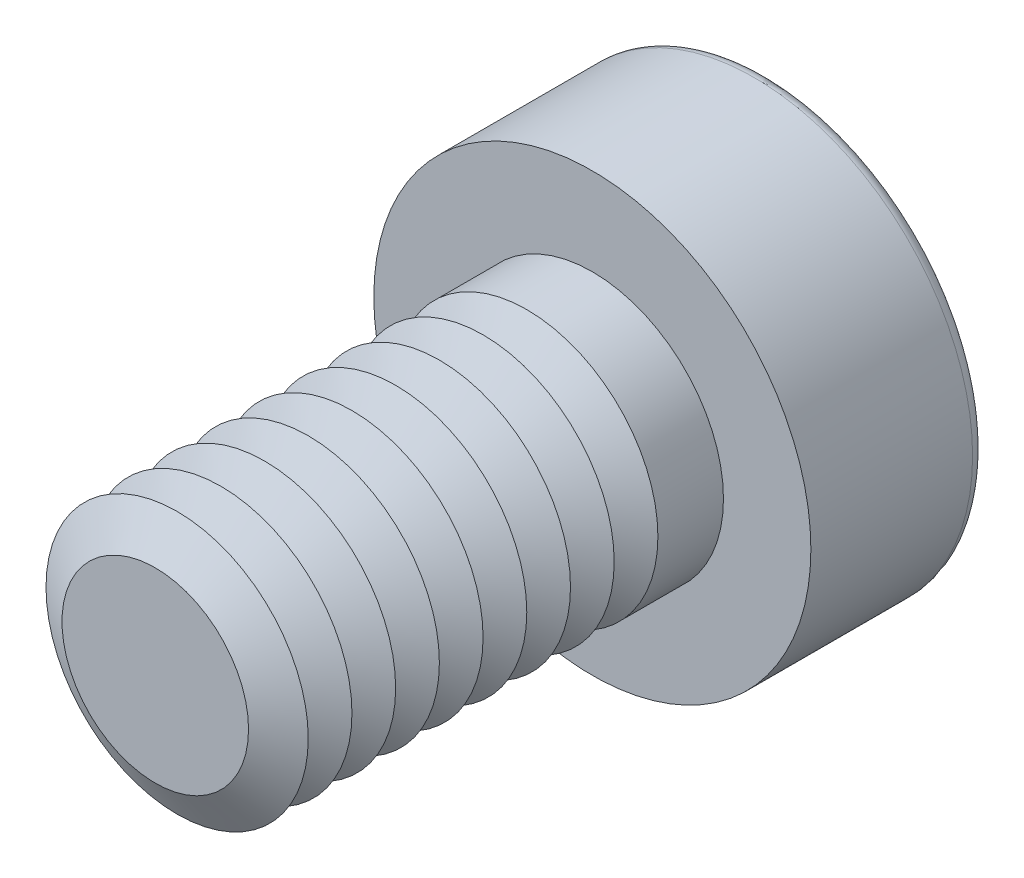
ISO-10303-21;
HEADER;
FILE_DESCRIPTION(('STEP AP214'),'2;1');
FILE_NAME('part.step','',(''),(''),'','','');
FILE_SCHEMA(('AUTOMOTIVE_DESIGN { 1 0 10303 214 1 1 1 1 }'));
ENDSEC;
DATA;
#1=APPLICATION_CONTEXT('core data for automotive mechanical design processes');
#2=APPLICATION_PROTOCOL_DEFINITION('international standard','automotive_design',2000,#1);
#3=PRODUCT_CONTEXT('',#1,'mechanical');
#4=PRODUCT('Part','Part','',(#3));
#5=PRODUCT_RELATED_PRODUCT_CATEGORY('part','',(#4));
#6=PRODUCT_DEFINITION_FORMATION('','',#4);
#7=PRODUCT_DEFINITION_CONTEXT('part definition',#1,'design');
#8=PRODUCT_DEFINITION('design','',#6,#7);
#9=PRODUCT_DEFINITION_SHAPE('','',#8);
#10=(LENGTH_UNIT() NAMED_UNIT(*) SI_UNIT(.MILLI.,.METRE.));
#11=(NAMED_UNIT(*) PLANE_ANGLE_UNIT() SI_UNIT($,.RADIAN.));
#12=(NAMED_UNIT(*) SI_UNIT($,.STERADIAN.) SOLID_ANGLE_UNIT());
#13=UNCERTAINTY_MEASURE_WITH_UNIT(LENGTH_MEASURE(1.E-05),#10,'distance_accuracy_value','');
#14=(GEOMETRIC_REPRESENTATION_CONTEXT(3) GLOBAL_UNCERTAINTY_ASSIGNED_CONTEXT((#13)) GLOBAL_UNIT_ASSIGNED_CONTEXT((#10,
#11,#12)) REPRESENTATION_CONTEXT('',''));
#15=CARTESIAN_POINT('',(0.,0.,0.));
#16=DIRECTION('',(0.,0.,1.));
#17=DIRECTION('',(1.,0.,0.));
#18=AXIS2_PLACEMENT_3D('',#15,#16,#17);
#19=CARTESIAN_POINT('',(0.,0.,6.5));
#20=DIRECTION('',(0.,0.,1.));
#21=DIRECTION('',(1.,0.,0.));
#22=AXIS2_PLACEMENT_3D('',#19,#20,#21);
#23=CONICAL_SURFACE('',#22,3.,1.0471975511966);
#24=CARTESIAN_POINT('',(0.,0.,6.));
#25=DIRECTION('',(0.,0.,1.));
#26=DIRECTION('',(1.,0.,0.));
#27=AXIS2_PLACEMENT_3D('',#24,#25,#26);
#28=CIRCLE('',#27,2.13397459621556);
#29=CARTESIAN_POINT('',(2.13397459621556,0.,6.));
#30=VERTEX_POINT('',#29);
#31=EDGE_CURVE('E312',#30,#30,#28,.T.);
#32=ORIENTED_EDGE('',*,*,#31,.T.);
#33=EDGE_LOOP('',(#32));
#34=FACE_BOUND('',#33,.T.);
#35=CARTESIAN_POINT('',(0.,0.,6.5));
#36=DIRECTION('',(0.,0.,1.));
#37=DIRECTION('',(1.,0.,0.));
#38=AXIS2_PLACEMENT_3D('',#35,#36,#37);
#39=CIRCLE('',#38,3.);
#40=CARTESIAN_POINT('',(3.,0.,6.5));
#41=VERTEX_POINT('',#40);
#42=EDGE_CURVE('E315',#41,#41,#39,.T.);
#43=ORIENTED_EDGE('',*,*,#42,.F.);
#44=EDGE_LOOP('',(#43));
#45=FACE_BOUND('',#44,.T.);
#46=ADVANCED_FACE('F39',(#34,#45),#23,.T.);
#47=CARTESIAN_POINT('',(0.,0.,6.));
#48=DIRECTION('',(0.,0.,-1.));
#49=DIRECTION('',(-1.,0.,0.));
#50=AXIS2_PLACEMENT_3D('',#47,#48,#49);
#51=CONICAL_SURFACE('',#50,2.13397459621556,1.0471975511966);
#52=CARTESIAN_POINT('',(0.,0.,5.5));
#53=DIRECTION('',(0.,0.,1.));
#54=DIRECTION('',(1.,0.,0.));
#55=AXIS2_PLACEMENT_3D('',#52,#53,#54);
#56=CIRCLE('',#55,3.);
#57=CARTESIAN_POINT('',(3.,0.,5.5));
#58=VERTEX_POINT('',#57);
#59=EDGE_CURVE('E323',#58,#58,#56,.T.);
#60=ORIENTED_EDGE('',*,*,#59,.T.);
#61=EDGE_LOOP('',(#60));
#62=FACE_BOUND('',#61,.T.);
#63=ORIENTED_EDGE('',*,*,#31,.F.);
#64=EDGE_LOOP('',(#63));
#65=FACE_BOUND('',#64,.T.);
#66=ADVANCED_FACE('F244',(#62,#65),#51,.T.);
#67=CARTESIAN_POINT('',(0.,0.,10.));
#68=DIRECTION('',(0.,0.,1.));
#69=DIRECTION('',(1.,0.,0.));
#70=AXIS2_PLACEMENT_3D('',#67,#68,#69);
#71=PLANE('',#70);
#72=CARTESIAN_POINT('',(0.,0.,10.));
#73=DIRECTION('',(0.,0.,1.));
#74=DIRECTION('',(1.,0.,0.));
#75=AXIS2_PLACEMENT_3D('',#72,#73,#74);
#76=CIRCLE('',#75,2.13397459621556);
#77=CARTESIAN_POINT('',(2.13397459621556,0.,10.));
#78=VERTEX_POINT('',#77);
#79=EDGE_CURVE('E174',#78,#78,#76,.T.);
#80=ORIENTED_EDGE('',*,*,#79,.T.);
#81=EDGE_LOOP('',(#80));
#82=FACE_BOUND('',#81,.T.);
#83=ADVANCED_FACE('F250',(#82),#71,.T.);
#84=CARTESIAN_POINT('',(0.,0.,10.));
#85=DIRECTION('',(0.,0.,-1.));
#86=DIRECTION('',(-1.,0.,0.));
#87=AXIS2_PLACEMENT_3D('',#84,#85,#86);
#88=CONICAL_SURFACE('',#87,2.13397459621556,1.0471975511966);
#89=CARTESIAN_POINT('',(0.,0.,9.5));
#90=DIRECTION('',(0.,0.,1.));
#91=DIRECTION('',(1.,0.,0.));
#92=AXIS2_PLACEMENT_3D('',#89,#90,#91);
#93=CIRCLE('',#92,3.);
#94=CARTESIAN_POINT('',(3.,0.,9.5));
#95=VERTEX_POINT('',#94);
#96=EDGE_CURVE('E290',#95,#95,#93,.T.);
#97=ORIENTED_EDGE('',*,*,#96,.T.);
#98=EDGE_LOOP('',(#97));
#99=FACE_BOUND('',#98,.T.);
#100=ORIENTED_EDGE('',*,*,#79,.F.);
#101=EDGE_LOOP('',(#100));
#102=FACE_BOUND('',#101,.T.);
#103=ADVANCED_FACE('F198',(#99,#102),#88,.T.);
#104=CARTESIAN_POINT('',(0.,0.,9.5));
#105=DIRECTION('',(0.,0.,1.));
#106=DIRECTION('',(1.,0.,0.));
#107=AXIS2_PLACEMENT_3D('',#104,#105,#106);
#108=CONICAL_SURFACE('',#107,3.,1.0471975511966);
#109=CARTESIAN_POINT('',(0.,0.,9.));
#110=DIRECTION('',(0.,0.,1.));
#111=DIRECTION('',(1.,0.,0.));
#112=AXIS2_PLACEMENT_3D('',#109,#110,#111);
#113=CIRCLE('',#112,2.13397459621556);
#114=CARTESIAN_POINT('',(2.13397459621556,0.,9.));
#115=VERTEX_POINT('',#114);
#116=EDGE_CURVE('E287',#115,#115,#113,.T.);
#117=ORIENTED_EDGE('',*,*,#116,.T.);
#118=EDGE_LOOP('',(#117));
#119=FACE_BOUND('',#118,.T.);
#120=ORIENTED_EDGE('',*,*,#96,.F.);
#121=EDGE_LOOP('',(#120));
#122=FACE_BOUND('',#121,.T.);
#123=ADVANCED_FACE('F276',(#119,#122),#108,.T.);
#124=CARTESIAN_POINT('',(0.,0.,9.));
#125=DIRECTION('',(0.,0.,-1.));
#126=DIRECTION('',(-1.,0.,0.));
#127=AXIS2_PLACEMENT_3D('',#124,#125,#126);
#128=CONICAL_SURFACE('',#127,2.13397459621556,1.0471975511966);
#129=CARTESIAN_POINT('',(0.,0.,8.5));
#130=DIRECTION('',(0.,0.,1.));
#131=DIRECTION('',(1.,0.,0.));
#132=AXIS2_PLACEMENT_3D('',#129,#130,#131);
#133=CIRCLE('',#132,3.);
#134=CARTESIAN_POINT('',(3.,0.,8.5));
#135=VERTEX_POINT('',#134);
#136=EDGE_CURVE('E298',#135,#135,#133,.T.);
#137=ORIENTED_EDGE('',*,*,#136,.T.);
#138=EDGE_LOOP('',(#137));
#139=FACE_BOUND('',#138,.T.);
#140=ORIENTED_EDGE('',*,*,#116,.F.);
#141=EDGE_LOOP('',(#140));
#142=FACE_BOUND('',#141,.T.);
#143=ADVANCED_FACE('F273',(#139,#142),#128,.T.);
#144=CARTESIAN_POINT('',(0.,0.,8.5));
#145=DIRECTION('',(0.,0.,1.));
#146=DIRECTION('',(1.,0.,0.));
#147=AXIS2_PLACEMENT_3D('',#144,#145,#146);
#148=CONICAL_SURFACE('',#147,3.,1.0471975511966);
#149=CARTESIAN_POINT('',(0.,0.,8.));
#150=DIRECTION('',(0.,0.,1.));
#151=DIRECTION('',(1.,0.,0.));
#152=AXIS2_PLACEMENT_3D('',#149,#150,#151);
#153=CIRCLE('',#152,2.13397459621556);
#154=CARTESIAN_POINT('',(2.13397459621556,0.,8.));
#155=VERTEX_POINT('',#154);
#156=EDGE_CURVE('E292',#155,#155,#153,.T.);
#157=ORIENTED_EDGE('',*,*,#156,.T.);
#158=EDGE_LOOP('',(#157));
#159=FACE_BOUND('',#158,.T.);
#160=ORIENTED_EDGE('',*,*,#136,.F.);
#161=EDGE_LOOP('',(#160));
#162=FACE_BOUND('',#161,.T.);
#163=ADVANCED_FACE('F269',(#159,#162),#148,.T.);
#164=CARTESIAN_POINT('',(0.,0.,8.));
#165=DIRECTION('',(0.,0.,-1.));
#166=DIRECTION('',(-1.,0.,0.));
#167=AXIS2_PLACEMENT_3D('',#164,#165,#166);
#168=CONICAL_SURFACE('',#167,2.13397459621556,1.0471975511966);
#169=CARTESIAN_POINT('',(0.,0.,7.5));
#170=DIRECTION('',(0.,0.,1.));
#171=DIRECTION('',(1.,0.,0.));
#172=AXIS2_PLACEMENT_3D('',#169,#170,#171);
#173=CIRCLE('',#172,3.);
#174=CARTESIAN_POINT('',(3.,0.,7.5));
#175=VERTEX_POINT('',#174);
#176=EDGE_CURVE('E308',#175,#175,#173,.T.);
#177=ORIENTED_EDGE('',*,*,#176,.T.);
#178=EDGE_LOOP('',(#177));
#179=FACE_BOUND('',#178,.T.);
#180=ORIENTED_EDGE('',*,*,#156,.F.);
#181=EDGE_LOOP('',(#180));
#182=FACE_BOUND('',#181,.T.);
#183=ADVANCED_FACE('F265',(#179,#182),#168,.T.);
#184=CARTESIAN_POINT('',(0.,0.,7.5));
#185=DIRECTION('',(0.,0.,1.));
#186=DIRECTION('',(1.,0.,0.));
#187=AXIS2_PLACEMENT_3D('',#184,#185,#186);
#188=CONICAL_SURFACE('',#187,3.,1.0471975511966);
#189=CARTESIAN_POINT('',(0.,0.,7.));
#190=DIRECTION('',(0.,0.,1.));
#191=DIRECTION('',(1.,0.,0.));
#192=AXIS2_PLACEMENT_3D('',#189,#190,#191);
#193=CIRCLE('',#192,2.13397459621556);
#194=CARTESIAN_POINT('',(2.13397459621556,0.,7.));
#195=VERTEX_POINT('',#194);
#196=EDGE_CURVE('E304',#195,#195,#193,.T.);
#197=ORIENTED_EDGE('',*,*,#196,.T.);
#198=EDGE_LOOP('',(#197));
#199=FACE_BOUND('',#198,.T.);
#200=ORIENTED_EDGE('',*,*,#176,.F.);
#201=EDGE_LOOP('',(#200));
#202=FACE_BOUND('',#201,.T.);
#203=ADVANCED_FACE('F261',(#199,#202),#188,.T.);
#204=CARTESIAN_POINT('',(0.,0.,7.));
#205=DIRECTION('',(0.,0.,-1.));
#206=DIRECTION('',(-1.,0.,0.));
#207=AXIS2_PLACEMENT_3D('',#204,#205,#206);
#208=CONICAL_SURFACE('',#207,2.13397459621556,1.0471975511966);
#209=ORIENTED_EDGE('',*,*,#42,.T.);
#210=EDGE_LOOP('',(#209));
#211=FACE_BOUND('',#210,.T.);
#212=ORIENTED_EDGE('',*,*,#196,.F.);
#213=EDGE_LOOP('',(#212));
#214=FACE_BOUND('',#213,.T.);
#215=ADVANCED_FACE('F257',(#211,#214),#208,.T.);
#216=CARTESIAN_POINT('',(0.,0.,5.5));
#217=DIRECTION('',(0.,0.,1.));
#218=DIRECTION('',(1.,0.,0.));
#219=AXIS2_PLACEMENT_3D('',#216,#217,#218);
#220=CONICAL_SURFACE('',#219,3.,1.0471975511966);
#221=CARTESIAN_POINT('',(0.,0.,5.));
#222=DIRECTION('',(0.,0.,1.));
#223=DIRECTION('',(1.,0.,0.));
#224=AXIS2_PLACEMENT_3D('',#221,#222,#223);
#225=CIRCLE('',#224,2.13397459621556);
#226=CARTESIAN_POINT('',(2.13397459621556,0.,5.));
#227=VERTEX_POINT('',#226);
#228=EDGE_CURVE('E319',#227,#227,#225,.T.);
#229=ORIENTED_EDGE('',*,*,#228,.T.);
#230=EDGE_LOOP('',(#229));
#231=FACE_BOUND('',#230,.T.);
#232=ORIENTED_EDGE('',*,*,#59,.F.);
#233=EDGE_LOOP('',(#232));
#234=FACE_BOUND('',#233,.T.);
#235=ADVANCED_FACE('F260',(#231,#234),#220,.T.);
#236=CARTESIAN_POINT('',(0.,0.,5.));
#237=DIRECTION('',(0.,0.,-1.));
#238=DIRECTION('',(-1.,0.,0.));
#239=AXIS2_PLACEMENT_3D('',#236,#237,#238);
#240=CONICAL_SURFACE('',#239,2.13397459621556,1.0471975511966);
#241=CARTESIAN_POINT('',(0.,0.,4.5));
#242=DIRECTION('',(0.,0.,1.));
#243=DIRECTION('',(1.,0.,0.));
#244=AXIS2_PLACEMENT_3D('',#241,#242,#243);
#245=CIRCLE('',#244,3.);
#246=CARTESIAN_POINT('',(3.,0.,4.5));
#247=VERTEX_POINT('',#246);
#248=EDGE_CURVE('E330',#247,#247,#245,.T.);
#249=ORIENTED_EDGE('',*,*,#248,.T.);
#250=EDGE_LOOP('',(#249));
#251=FACE_BOUND('',#250,.T.);
#252=ORIENTED_EDGE('',*,*,#228,.F.);
#253=EDGE_LOOP('',(#252));
#254=FACE_BOUND('',#253,.T.);
#255=ADVANCED_FACE('F384',(#251,#254),#240,.T.);
#256=CARTESIAN_POINT('',(0.,0.,4.5));
#257=DIRECTION('',(0.,0.,1.));
#258=DIRECTION('',(1.,0.,0.));
#259=AXIS2_PLACEMENT_3D('',#256,#257,#258);
#260=CONICAL_SURFACE('',#259,3.,1.0471975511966);
#261=CARTESIAN_POINT('',(0.,0.,4.));
#262=DIRECTION('',(0.,0.,1.));
#263=DIRECTION('',(1.,0.,0.));
#264=AXIS2_PLACEMENT_3D('',#261,#262,#263);
#265=CIRCLE('',#264,2.13397459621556);
#266=CARTESIAN_POINT('',(2.13397459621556,0.,4.));
#267=VERTEX_POINT('',#266);
#268=EDGE_CURVE('E326',#267,#267,#265,.T.);
#269=ORIENTED_EDGE('',*,*,#268,.T.);
#270=EDGE_LOOP('',(#269));
#271=FACE_BOUND('',#270,.T.);
#272=ORIENTED_EDGE('',*,*,#248,.F.);
#273=EDGE_LOOP('',(#272));
#274=FACE_BOUND('',#273,.T.);
#275=ADVANCED_FACE('F380',(#271,#274),#260,.T.);
#276=CARTESIAN_POINT('',(0.,0.,4.));
#277=DIRECTION('',(0.,0.,-1.));
#278=DIRECTION('',(-1.,0.,0.));
#279=AXIS2_PLACEMENT_3D('',#276,#277,#278);
#280=CONICAL_SURFACE('',#279,2.13397459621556,1.0471975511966);
#281=CARTESIAN_POINT('',(0.,0.,3.5));
#282=DIRECTION('',(0.,0.,1.));
#283=DIRECTION('',(1.,0.,0.));
#284=AXIS2_PLACEMENT_3D('',#281,#282,#283);
#285=CIRCLE('',#284,3.);
#286=CARTESIAN_POINT('',(3.,0.,3.5));
#287=VERTEX_POINT('',#286);
#288=EDGE_CURVE('E338',#287,#287,#285,.T.);
#289=ORIENTED_EDGE('',*,*,#288,.T.);
#290=EDGE_LOOP('',(#289));
#291=FACE_BOUND('',#290,.T.);
#292=ORIENTED_EDGE('',*,*,#268,.F.);
#293=EDGE_LOOP('',(#292));
#294=FACE_BOUND('',#293,.T.);
#295=ADVANCED_FACE('F376',(#291,#294),#280,.T.);
#296=CARTESIAN_POINT('',(0.,0.,3.5));
#297=DIRECTION('',(0.,0.,1.));
#298=DIRECTION('',(1.,0.,0.));
#299=AXIS2_PLACEMENT_3D('',#296,#297,#298);
#300=CONICAL_SURFACE('',#299,3.,1.0471975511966);
#301=CARTESIAN_POINT('',(0.,0.,3.));
#302=DIRECTION('',(0.,0.,1.));
#303=DIRECTION('',(1.,0.,0.));
#304=AXIS2_PLACEMENT_3D('',#301,#302,#303);
#305=CIRCLE('',#304,2.13397459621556);
#306=CARTESIAN_POINT('',(2.13397459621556,0.,3.));
#307=VERTEX_POINT('',#306);
#308=EDGE_CURVE('E334',#307,#307,#305,.T.);
#309=ORIENTED_EDGE('',*,*,#308,.T.);
#310=EDGE_LOOP('',(#309));
#311=FACE_BOUND('',#310,.T.);
#312=ORIENTED_EDGE('',*,*,#288,.F.);
#313=EDGE_LOOP('',(#312));
#314=FACE_BOUND('',#313,.T.);
#315=ADVANCED_FACE('F371',(#311,#314),#300,.T.);
#316=CARTESIAN_POINT('',(0.,0.,3.));
#317=DIRECTION('',(0.,0.,-1.));
#318=DIRECTION('',(-1.,0.,0.));
#319=AXIS2_PLACEMENT_3D('',#316,#317,#318);
#320=CONICAL_SURFACE('',#319,2.13397459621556,1.0471975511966);
#321=CARTESIAN_POINT('',(0.,0.,2.5));
#322=DIRECTION('',(0.,0.,1.));
#323=DIRECTION('',(1.,0.,0.));
#324=AXIS2_PLACEMENT_3D('',#321,#322,#323);
#325=CIRCLE('',#324,3.);
#326=CARTESIAN_POINT('',(3.,0.,2.5));
#327=VERTEX_POINT('',#326);
#328=EDGE_CURVE('E350',#327,#327,#325,.T.);
#329=ORIENTED_EDGE('',*,*,#328,.T.);
#330=EDGE_LOOP('',(#329));
#331=FACE_BOUND('',#330,.T.);
#332=ORIENTED_EDGE('',*,*,#308,.F.);
#333=EDGE_LOOP('',(#332));
#334=FACE_BOUND('',#333,.T.);
#335=ADVANCED_FACE('F357',(#331,#334),#320,.T.);
#336=CARTESIAN_POINT('',(0.,0.,2.5));
#337=DIRECTION('',(0.,0.,1.));
#338=DIRECTION('',(1.,0.,0.));
#339=AXIS2_PLACEMENT_3D('',#336,#337,#338);
#340=CONICAL_SURFACE('',#339,3.,1.0471975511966);
#341=CARTESIAN_POINT('',(0.,0.,2.));
#342=DIRECTION('',(0.,0.,1.));
#343=DIRECTION('',(1.,0.,0.));
#344=AXIS2_PLACEMENT_3D('',#341,#342,#343);
#345=CIRCLE('',#344,2.13397459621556);
#346=CARTESIAN_POINT('',(2.13397459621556,0.,2.));
#347=VERTEX_POINT('',#346);
#348=EDGE_CURVE('E342',#347,#347,#345,.T.);
#349=ORIENTED_EDGE('',*,*,#348,.T.);
#350=EDGE_LOOP('',(#349));
#351=FACE_BOUND('',#350,.T.);
#352=ORIENTED_EDGE('',*,*,#328,.F.);
#353=EDGE_LOOP('',(#352));
#354=FACE_BOUND('',#353,.T.);
#355=ADVANCED_FACE('F360',(#351,#354),#340,.T.);
#356=CARTESIAN_POINT('',(0.,0.,2.));
#357=DIRECTION('',(0.,0.,-1.));
#358=DIRECTION('',(-1.,0.,0.));
#359=AXIS2_PLACEMENT_3D('',#356,#357,#358);
#360=CONICAL_SURFACE('',#359,2.13397459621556,1.0471975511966);
#361=CARTESIAN_POINT('',(0.,0.,1.5));
#362=DIRECTION('',(0.,0.,1.));
#363=DIRECTION('',(1.,0.,0.));
#364=AXIS2_PLACEMENT_3D('',#361,#362,#363);
#365=CIRCLE('',#364,3.);
#366=CARTESIAN_POINT('',(3.,0.,1.5));
#367=VERTEX_POINT('',#366);
#368=EDGE_CURVE('E346',#367,#367,#365,.T.);
#369=ORIENTED_EDGE('',*,*,#368,.T.);
#370=EDGE_LOOP('',(#369));
#371=FACE_BOUND('',#370,.T.);
#372=ORIENTED_EDGE('',*,*,#348,.F.);
#373=EDGE_LOOP('',(#372));
#374=FACE_BOUND('',#373,.T.);
#375=ADVANCED_FACE('F362',(#371,#374),#360,.T.);
#376=CARTESIAN_POINT('',(0.,0.,-1.));
#377=DIRECTION('',(0.,0.,-1.));
#378=DIRECTION('',(-1.,0.,0.));
#379=AXIS2_PLACEMENT_3D('',#376,#377,#378);
#380=CONICAL_SURFACE('',#379,2.,1.0471975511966);
#381=CARTESIAN_POINT('',(0.,0.,0.154700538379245));
#382=VERTEX_POINT('',#381);
#383=VERTEX_LOOP('',#382);
#384=FACE_BOUND('',#383,.T.);
#385=CARTESIAN_POINT('',(0.,0.,-1.));
#386=DIRECTION('',(0.,0.,-1.));
#387=DIRECTION('',(-1.,0.,0.));
#388=AXIS2_PLACEMENT_3D('',#385,#386,#387);
#389=CIRCLE('',#388,2.);
#390=CARTESIAN_POINT('',(-1.73205080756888,0.999999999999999,-1.));
#391=VERTEX_POINT('',#390);
#392=CARTESIAN_POINT('',(0.,2.,-1.));
#393=VERTEX_POINT('',#392);
#394=EDGE_CURVE('E149',#391,#393,#389,.T.);
#395=ORIENTED_EDGE('',*,*,#394,.T.);
#396=CARTESIAN_POINT('',(0.,0.,-1.));
#397=DIRECTION('',(0.,0.,-1.));
#398=DIRECTION('',(-1.,0.,0.));
#399=AXIS2_PLACEMENT_3D('',#396,#397,#398);
#400=CIRCLE('',#399,2.);
#401=CARTESIAN_POINT('',(1.73205080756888,1.,-1.));
#402=VERTEX_POINT('',#401);
#403=EDGE_CURVE('E54',#393,#402,#400,.T.);
#404=ORIENTED_EDGE('',*,*,#403,.T.);
#405=CARTESIAN_POINT('',(1.73205080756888,-0.999999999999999,-1.));
#406=VERTEX_POINT('',#405);
#407=EDGE_CURVE('E788',#402,#406,#400,.T.);
#408=ORIENTED_EDGE('',*,*,#407,.T.);
#409=CARTESIAN_POINT('',(0.,-2.,-1.));
#410=VERTEX_POINT('',#409);
#411=EDGE_CURVE('E787',#406,#410,#400,.T.);
#412=ORIENTED_EDGE('',*,*,#411,.T.);
#413=CARTESIAN_POINT('',(-1.73205080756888,-0.999999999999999,-1.));
#414=VERTEX_POINT('',#413);
#415=EDGE_CURVE('E783',#410,#414,#400,.T.);
#416=ORIENTED_EDGE('',*,*,#415,.T.);
#417=EDGE_CURVE('E781',#414,#391,#400,.T.);
#418=ORIENTED_EDGE('',*,*,#417,.T.);
#419=EDGE_LOOP('',(#395,#404,#408,#412,#416,#418));
#420=FACE_BOUND('',#419,.T.);
#421=ADVANCED_FACE('F200',(#384,#420),#380,.F.);
#422=CARTESIAN_POINT('',(0.,0.,-1.));
#423=DIRECTION('',(0.,0.,-1.));
#424=DIRECTION('',(-1.,0.,0.));
#425=AXIS2_PLACEMENT_3D('',#422,#423,#424);
#426=PLANE('',#425);
#427=ORIENTED_EDGE('',*,*,#403,.F.);
#428=DIRECTION('',(1.,0.,0.));
#429=VECTOR('',#428,1.);
#430=CARTESIAN_POINT('',(-1.15470053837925,2.,-1.));
#431=LINE('',#430,#429);
#432=CARTESIAN_POINT('',(1.15470053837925,2.,-1.));
#433=VERTEX_POINT('',#432);
#434=EDGE_CURVE('E829',#393,#433,#431,.T.);
#435=ORIENTED_EDGE('',*,*,#434,.T.);
#436=DIRECTION('',(0.5,-0.866025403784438,0.));
#437=VECTOR('',#436,1.);
#438=CARTESIAN_POINT('',(1.15470053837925,2.,-1.));
#439=LINE('',#438,#437);
#440=EDGE_CURVE('E155',#433,#402,#439,.T.);
#441=ORIENTED_EDGE('',*,*,#440,.T.);
#442=EDGE_LOOP('',(#427,#435,#441));
#443=FACE_BOUND('',#442,.T.);
#444=ADVANCED_FACE('F431',(#443),#426,.T.);
#445=ORIENTED_EDGE('',*,*,#407,.F.);
#446=CARTESIAN_POINT('',(2.3094010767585,0.,-1.));
#447=VERTEX_POINT('',#446);
#448=EDGE_CURVE('E824',#402,#447,#439,.T.);
#449=ORIENTED_EDGE('',*,*,#448,.T.);
#450=DIRECTION('',(-0.5,-0.866025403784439,0.));
#451=VECTOR('',#450,1.);
#452=CARTESIAN_POINT('',(2.3094010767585,0.,-1.));
#453=LINE('',#452,#451);
#454=EDGE_CURVE('E801',#447,#406,#453,.T.);
#455=ORIENTED_EDGE('',*,*,#454,.T.);
#456=EDGE_LOOP('',(#445,#449,#455));
#457=FACE_BOUND('',#456,.T.);
#458=ADVANCED_FACE('F441',(#457),#426,.T.);
#459=ORIENTED_EDGE('',*,*,#411,.F.);
#460=CARTESIAN_POINT('',(1.15470053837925,-2.,-1.));
#461=VERTEX_POINT('',#460);
#462=EDGE_CURVE('E803',#406,#461,#453,.T.);
#463=ORIENTED_EDGE('',*,*,#462,.T.);
#464=DIRECTION('',(-1.,0.,0.));
#465=VECTOR('',#464,1.);
#466=CARTESIAN_POINT('',(1.15470053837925,-2.,-1.));
#467=LINE('',#466,#465);
#468=EDGE_CURVE('E755',#461,#410,#467,.T.);
#469=ORIENTED_EDGE('',*,*,#468,.T.);
#470=EDGE_LOOP('',(#459,#463,#469));
#471=FACE_BOUND('',#470,.T.);
#472=ADVANCED_FACE('F451',(#471),#426,.T.);
#473=ORIENTED_EDGE('',*,*,#415,.F.);
#474=CARTESIAN_POINT('',(-1.15470053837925,-2.,-1.));
#475=VERTEX_POINT('',#474);
#476=EDGE_CURVE('E798',#410,#475,#467,.T.);
#477=ORIENTED_EDGE('',*,*,#476,.T.);
#478=DIRECTION('',(-0.5,0.866025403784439,0.));
#479=VECTOR('',#478,1.);
#480=CARTESIAN_POINT('',(-1.15470053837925,-2.,-1.));
#481=LINE('',#480,#479);
#482=EDGE_CURVE('E800',#475,#414,#481,.T.);
#483=ORIENTED_EDGE('',*,*,#482,.T.);
#484=EDGE_LOOP('',(#473,#477,#483));
#485=FACE_BOUND('',#484,.T.);
#486=ADVANCED_FACE('F459',(#485),#426,.T.);
#487=ORIENTED_EDGE('',*,*,#417,.F.);
#488=CARTESIAN_POINT('',(-2.3094010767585,0.,-1.));
#489=VERTEX_POINT('',#488);
#490=EDGE_CURVE('E805',#414,#489,#481,.T.);
#491=ORIENTED_EDGE('',*,*,#490,.T.);
#492=DIRECTION('',(0.5,0.866025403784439,0.));
#493=VECTOR('',#492,1.);
#494=CARTESIAN_POINT('',(-2.3094010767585,0.,-1.));
#495=LINE('',#494,#493);
#496=EDGE_CURVE('E158',#489,#391,#495,.T.);
#497=ORIENTED_EDGE('',*,*,#496,.T.);
#498=EDGE_LOOP('',(#487,#491,#497));
#499=FACE_BOUND('',#498,.T.);
#500=ADVANCED_FACE('F230',(#499),#426,.T.);
#501=ORIENTED_EDGE('',*,*,#394,.F.);
#502=CARTESIAN_POINT('',(-1.15470053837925,2.,-1.));
#503=VERTEX_POINT('',#502);
#504=EDGE_CURVE('E811',#391,#503,#495,.T.);
#505=ORIENTED_EDGE('',*,*,#504,.T.);
#506=EDGE_CURVE('E826',#503,#393,#431,.T.);
#507=ORIENTED_EDGE('',*,*,#506,.T.);
#508=EDGE_LOOP('',(#501,#505,#507));
#509=FACE_BOUND('',#508,.T.);
#510=ADVANCED_FACE('F443',(#509),#426,.T.);
#511=CARTESIAN_POINT('',(-1.15470053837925,2.,-1.));
#512=DIRECTION('',(0.,1.,0.));
#513=DIRECTION('',(0.,0.,1.));
#514=AXIS2_PLACEMENT_3D('',#511,#512,#513);
#515=PLANE('',#514);
#516=DIRECTION('',(0.,0.,-1.));
#517=VECTOR('',#516,1.);
#518=CARTESIAN_POINT('',(-1.15470053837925,2.,-1.));
#519=LINE('',#518,#517);
#520=CARTESIAN_POINT('',(-1.15470053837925,2.,-4.));
#521=VERTEX_POINT('',#520);
#522=EDGE_CURVE('E147',#503,#521,#519,.T.);
#523=ORIENTED_EDGE('',*,*,#522,.T.);
#524=CARTESIAN_POINT('',(-3.01440758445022,2.,-4.35051689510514));
#525=CARTESIAN_POINT('',(-2.92409762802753,2.,-4.33035636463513));
#526=CARTESIAN_POINT('',(-2.83373054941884,2.,-4.31045254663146));
#527=CARTESIAN_POINT('',(-2.65285291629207,2.,-4.27128852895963));
#528=CARTESIAN_POINT('',(-2.562342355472,2.,-4.25202835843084));
#529=CARTESIAN_POINT('',(-2.29037985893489,2.,-4.19537300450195));
#530=CARTESIAN_POINT('',(-2.10868043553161,2.,-4.15914446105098));
#531=CARTESIAN_POINT('',(-1.74597297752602,2.,-4.09171688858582));
#532=CARTESIAN_POINT('',(-1.56497266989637,2.,-4.06047686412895));
#533=CARTESIAN_POINT('',(-1.20186568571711,2.,-4.00513826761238));
#534=CARTESIAN_POINT('',(-1.01975924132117,2.,-3.98103824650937));
#535=CARTESIAN_POINT('',(-0.744747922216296,2.,-3.9525901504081));
#536=CARTESIAN_POINT('',(-0.652245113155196,2.,-3.9443671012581));
#537=CARTESIAN_POINT('',(-0.467020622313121,2.,-3.93099406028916));
#538=CARTESIAN_POINT('',(-0.374298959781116,2.,-3.92584380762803));
#539=CARTESIAN_POINT('',(-0.188764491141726,2.,-3.91891540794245));
#540=CARTESIAN_POINT('',(-0.0959517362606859,2.,-3.91713591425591));
#541=CARTESIAN_POINT('',(0.0896753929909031,2.,-3.91705786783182));
#542=CARTESIAN_POINT('',(0.182489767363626,2.,-3.91875932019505));
#543=CARTESIAN_POINT('',(0.368369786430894,2.,-3.92554892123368));
#544=CARTESIAN_POINT('',(0.461434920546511,2.,-3.93065079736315));
#545=CARTESIAN_POINT('',(0.647346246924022,2.,-3.94395663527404));
#546=CARTESIAN_POINT('',(0.740192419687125,2.,-3.95216086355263));
#547=CARTESIAN_POINT('',(1.01841374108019,2.,-3.98081777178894));
#548=CARTESIAN_POINT('',(1.2033713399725,2.,-4.00531018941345));
#549=CARTESIAN_POINT('',(1.57694396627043,2.,-4.06236202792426));
#550=CARTESIAN_POINT('',(1.76552771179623,2.,-4.09511615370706));
#551=CARTESIAN_POINT('',(2.14178491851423,2.,-4.1655706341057));
#552=CARTESIAN_POINT('',(2.32945822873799,2.,-4.20327178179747));
#553=CARTESIAN_POINT('',(2.70417911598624,2.,-4.28188312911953));
#554=CARTESIAN_POINT('',(2.89122649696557,2.,-4.32279425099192));
#555=CARTESIAN_POINT('',(3.26484478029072,2.,-4.40674298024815));
#556=CARTESIAN_POINT('',(3.45141567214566,2.,-4.44978063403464));
#557=CARTESIAN_POINT('',(3.821938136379,2.,-4.53678178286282));
#558=CARTESIAN_POINT('',(4.00589388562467,2.,-4.58072756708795));
#559=CARTESIAN_POINT('',(4.37356350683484,2.,-4.66963526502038));
#560=CARTESIAN_POINT('',(4.55727737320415,2.,-4.71459720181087));
#561=CARTESIAN_POINT('',(4.9242660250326,2.,-4.80519833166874));
#562=CARTESIAN_POINT('',(5.10754106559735,2.,-4.85083649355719));
#563=CARTESIAN_POINT('',(5.47394280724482,2.,-4.94267693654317));
#564=CARTESIAN_POINT('',(5.65706951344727,2.,-4.98887919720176));
#565=CARTESIAN_POINT('',(5.84014583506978,2.,-5.03527803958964));
#566=B_SPLINE_CURVE_WITH_KNOTS('',3,(#524,#525,#526,#527,#528,#529,#530,#531,#532,#533,#534,
#535,#536,#537,#538,#539,#540,#541,#542,#543,#544,#545,#546,#547,#548,#549,#550,#551,#552,#553,
#554,#555,#556,#557,#558,#559,#560,#561,#562,#563,#564,#565),.UNSPECIFIED.,.F.,.F.,(4,2,2,2,2,2,
2,2,2,2,2,2,2,2,2,2,2,2,2,2,4),(0.,0.277597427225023,0.555207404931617,1.11099118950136,
1.66194208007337,2.21278108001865,2.49134108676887,2.76987744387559,3.04830249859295,
3.32672796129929,3.60628428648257,3.88586463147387,4.44532615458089,5.0194589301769,
5.59368385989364,6.16807437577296,6.74247743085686,7.30986991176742,7.87727529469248,
8.44388991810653,9.01048407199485),.UNSPECIFIED.);
#567=CARTESIAN_POINT('',(1.15470053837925,2.,-4.));
#568=VERTEX_POINT('',#567);
#569=EDGE_CURVE('E124',#521,#568,#566,.T.);
#570=ORIENTED_EDGE('',*,*,#569,.T.);
#571=DIRECTION('',(0.,0.,-1.));
#572=VECTOR('',#571,1.);
#573=CARTESIAN_POINT('',(1.15470053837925,2.,-1.));
#574=LINE('',#573,#572);
#575=EDGE_CURVE('E143',#433,#568,#574,.T.);
#576=ORIENTED_EDGE('',*,*,#575,.F.);
#577=ORIENTED_EDGE('',*,*,#434,.F.);
#578=ORIENTED_EDGE('',*,*,#506,.F.);
#579=EDGE_LOOP('',(#523,#570,#576,#577,#578));
#580=FACE_BOUND('',#579,.T.);
#581=ADVANCED_FACE('F141',(#580),#515,.F.);
#582=CARTESIAN_POINT('',(1.15470053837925,2.,-1.));
#583=DIRECTION('',(0.866025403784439,0.5,0.));
#584=DIRECTION('',(-0.5,0.866025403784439,0.));
#585=AXIS2_PLACEMENT_3D('',#582,#583,#584);
#586=PLANE('',#585);
#587=ORIENTED_EDGE('',*,*,#575,.T.);
#588=CARTESIAN_POINT('',(1.15458506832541,2.0002,-4.00003094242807));
#589=CARTESIAN_POINT('',(1.20254643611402,1.91712847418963,-3.98717294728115));
#590=CARTESIAN_POINT('',(1.25059477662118,1.83390630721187,-3.97549990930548));
#591=CARTESIAN_POINT('',(1.3468611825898,1.66716800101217,-3.95499135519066));
#592=CARTESIAN_POINT('',(1.39507930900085,1.58365175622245,-3.94615699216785));
#593=CARTESIAN_POINT('',(1.49139287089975,1.41683177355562,-3.93184164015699));
#594=CARTESIAN_POINT('',(1.53948765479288,1.33352916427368,-3.92634357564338));
#595=CARTESIAN_POINT('',(1.63573857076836,1.1668176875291,-3.91897122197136));
#596=CARTESIAN_POINT('',(1.68389468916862,1.08340884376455,-3.91709623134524));
#597=CARTESIAN_POINT('',(1.78020692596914,0.916591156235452,-3.91709623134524));
#598=CARTESIAN_POINT('',(1.82836304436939,0.833182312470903,-3.91897122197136));
#599=CARTESIAN_POINT('',(1.92461396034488,0.666470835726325,-3.92634357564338));
#600=CARTESIAN_POINT('',(1.972708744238,0.583168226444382,-3.93184164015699));
#601=CARTESIAN_POINT('',(2.06902230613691,0.416348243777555,-3.94615699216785));
#602=CARTESIAN_POINT('',(2.11724043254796,0.332831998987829,-3.95499135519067));
#603=CARTESIAN_POINT('',(2.21350683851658,0.16609369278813,-3.97549990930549));
#604=CARTESIAN_POINT('',(2.26155517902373,0.0828715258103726,-3.98717294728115));
#605=CARTESIAN_POINT('',(2.30951654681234,-0.000199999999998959,-4.00003094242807));
#606=B_SPLINE_CURVE_WITH_KNOTS('',3,(#588,#589,#590,#591,#592,#593,#594,#595,#596,#597,#598,
#599,#600,#601,#602,#603,#604,#605),.UNSPECIFIED.,.F.,.F.,(4,2,2,2,2,2,2,2,4),(0.,
0.29035724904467,0.580832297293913,0.869807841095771,1.15872743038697,1.44764701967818,
1.73662256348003,2.02709761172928,2.31745486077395),.UNSPECIFIED.);
#607=CARTESIAN_POINT('',(2.3094010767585,0.,-4.));
#608=VERTEX_POINT('',#607);
#609=EDGE_CURVE('E11',#568,#608,#606,.T.);
#610=ORIENTED_EDGE('',*,*,#609,.T.);
#611=DIRECTION('',(0.,0.,-1.));
#612=VECTOR('',#611,1.);
#613=CARTESIAN_POINT('',(2.3094010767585,0.,-1.));
#614=LINE('',#613,#612);
#615=EDGE_CURVE('E157',#447,#608,#614,.T.);
#616=ORIENTED_EDGE('',*,*,#615,.F.);
#617=ORIENTED_EDGE('',*,*,#448,.F.);
#618=ORIENTED_EDGE('',*,*,#440,.F.);
#619=EDGE_LOOP('',(#587,#610,#616,#617,#618));
#620=FACE_BOUND('',#619,.T.);
#621=ADVANCED_FACE('F152',(#620),#586,.F.);
#622=CARTESIAN_POINT('',(2.3094010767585,0.,-1.));
#623=DIRECTION('',(0.866025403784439,-0.5,0.));
#624=DIRECTION('',(0.5,0.866025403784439,0.));
#625=AXIS2_PLACEMENT_3D('',#622,#623,#624);
#626=PLANE('',#625);
#627=ORIENTED_EDGE('',*,*,#615,.T.);
#628=CARTESIAN_POINT('',(2.30951654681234,0.000200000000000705,-4.00003094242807));
#629=CARTESIAN_POINT('',(2.26155517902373,-0.0828715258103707,-3.98717294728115));
#630=CARTESIAN_POINT('',(2.21350683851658,-0.166093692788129,-3.97549990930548));
#631=CARTESIAN_POINT('',(2.11724043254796,-0.332831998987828,-3.95499135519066));
#632=CARTESIAN_POINT('',(2.06902230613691,-0.416348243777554,-3.94615699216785));
#633=CARTESIAN_POINT('',(1.972708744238,-0.583168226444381,-3.93184164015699));
#634=CARTESIAN_POINT('',(1.92461396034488,-0.666470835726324,-3.92634357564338));
#635=CARTESIAN_POINT('',(1.82836304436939,-0.833182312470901,-3.91897122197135));
#636=CARTESIAN_POINT('',(1.78020692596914,-0.91659115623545,-3.91709623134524));
#637=CARTESIAN_POINT('',(1.68389468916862,-1.08340884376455,-3.91709623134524));
#638=CARTESIAN_POINT('',(1.63573857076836,-1.1668176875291,-3.91897122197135));
#639=CARTESIAN_POINT('',(1.53948765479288,-1.33352916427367,-3.92634357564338));
#640=CARTESIAN_POINT('',(1.49139287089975,-1.41683177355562,-3.93184164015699));
#641=CARTESIAN_POINT('',(1.39507930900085,-1.58365175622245,-3.94615699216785));
#642=CARTESIAN_POINT('',(1.3468611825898,-1.66716800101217,-3.95499135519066));
#643=CARTESIAN_POINT('',(1.25059477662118,-1.83390630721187,-3.97549990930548));
#644=CARTESIAN_POINT('',(1.20254643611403,-1.91712847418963,-3.98717294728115));
#645=CARTESIAN_POINT('',(1.15458506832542,-2.0002,-4.00003094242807));
#646=B_SPLINE_CURVE_WITH_KNOTS('',3,(#628,#629,#630,#631,#632,#633,#634,#635,#636,#637,#638,
#639,#640,#641,#642,#643,#644,#645),.UNSPECIFIED.,.F.,.F.,(4,2,2,2,2,2,2,2,4),(0.,
0.290357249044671,0.580832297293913,0.869807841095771,1.15872743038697,1.44764701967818,
1.73662256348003,2.02709761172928,2.31745486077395),.UNSPECIFIED.);
#647=CARTESIAN_POINT('',(1.15470053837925,-2.,-4.));
#648=VERTEX_POINT('',#647);
#649=EDGE_CURVE('E173',#608,#648,#646,.T.);
#650=ORIENTED_EDGE('',*,*,#649,.T.);
#651=DIRECTION('',(0.,0.,-1.));
#652=VECTOR('',#651,1.);
#653=CARTESIAN_POINT('',(1.15470053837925,-2.,-1.));
#654=LINE('',#653,#652);
#655=EDGE_CURVE('E750',#461,#648,#654,.T.);
#656=ORIENTED_EDGE('',*,*,#655,.F.);
#657=ORIENTED_EDGE('',*,*,#462,.F.);
#658=ORIENTED_EDGE('',*,*,#454,.F.);
#659=EDGE_LOOP('',(#627,#650,#656,#657,#658));
#660=FACE_BOUND('',#659,.T.);
#661=ADVANCED_FACE('F190',(#660),#626,.F.);
#662=CARTESIAN_POINT('',(1.15470053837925,-2.,-1.));
#663=DIRECTION('',(0.,-1.,0.));
#664=DIRECTION('',(0.,0.,-1.));
#665=AXIS2_PLACEMENT_3D('',#662,#663,#664);
#666=PLANE('',#665);
#667=ORIENTED_EDGE('',*,*,#655,.T.);
#668=CARTESIAN_POINT('',(-3.01440758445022,-2.,-4.35051689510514));
#669=CARTESIAN_POINT('',(-2.92409762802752,-2.,-4.33035636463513));
#670=CARTESIAN_POINT('',(-2.83373054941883,-2.,-4.31045254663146));
#671=CARTESIAN_POINT('',(-2.65285291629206,-2.,-4.27128852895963));
#672=CARTESIAN_POINT('',(-2.562342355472,-2.,-4.25202835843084));
#673=CARTESIAN_POINT('',(-2.29037985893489,-2.,-4.19537300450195));
#674=CARTESIAN_POINT('',(-2.10868043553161,-2.,-4.15914446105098));
#675=CARTESIAN_POINT('',(-1.74597297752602,-2.,-4.09171688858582));
#676=CARTESIAN_POINT('',(-1.56497266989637,-2.,-4.06047686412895));
#677=CARTESIAN_POINT('',(-1.20186568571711,-2.,-4.00513826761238));
#678=CARTESIAN_POINT('',(-1.01975924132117,-2.,-3.98103824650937));
#679=CARTESIAN_POINT('',(-0.744747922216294,-2.,-3.9525901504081));
#680=CARTESIAN_POINT('',(-0.652245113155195,-2.,-3.9443671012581));
#681=CARTESIAN_POINT('',(-0.46702062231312,-2.,-3.93099406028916));
#682=CARTESIAN_POINT('',(-0.374298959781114,-2.,-3.92584380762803));
#683=CARTESIAN_POINT('',(-0.188764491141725,-2.,-3.91891540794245));
#684=CARTESIAN_POINT('',(-0.0959517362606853,-2.,-3.91713591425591));
#685=CARTESIAN_POINT('',(0.0896753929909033,-2.,-3.91705786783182));
#686=CARTESIAN_POINT('',(0.182489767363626,-2.,-3.91875932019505));
#687=CARTESIAN_POINT('',(0.368369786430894,-2.,-3.92554892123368));
#688=CARTESIAN_POINT('',(0.461434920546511,-2.,-3.93065079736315));
#689=CARTESIAN_POINT('',(0.647346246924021,-2.,-3.94395663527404));
#690=CARTESIAN_POINT('',(0.740192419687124,-2.,-3.95216086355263));
#691=CARTESIAN_POINT('',(1.01841374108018,-2.,-3.98081777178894));
#692=CARTESIAN_POINT('',(1.2033713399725,-2.,-4.00531018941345));
#693=CARTESIAN_POINT('',(1.57694396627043,-2.,-4.06236202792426));
#694=CARTESIAN_POINT('',(1.76552771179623,-2.,-4.09511615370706));
#695=CARTESIAN_POINT('',(2.14178491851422,-2.,-4.1655706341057));
#696=CARTESIAN_POINT('',(2.32945822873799,-2.,-4.20327178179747));
#697=CARTESIAN_POINT('',(2.70417911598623,-2.,-4.28188312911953));
#698=CARTESIAN_POINT('',(2.89122649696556,-2.,-4.32279425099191));
#699=CARTESIAN_POINT('',(3.26484478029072,-2.,-4.40674298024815));
#700=CARTESIAN_POINT('',(3.45141567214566,-2.,-4.44978063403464));
#701=CARTESIAN_POINT('',(3.821938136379,-2.,-4.53678178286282));
#702=CARTESIAN_POINT('',(4.00589388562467,-2.,-4.58072756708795));
#703=CARTESIAN_POINT('',(4.37356350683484,-2.,-4.66963526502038));
#704=CARTESIAN_POINT('',(4.55727737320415,-2.,-4.71459720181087));
#705=CARTESIAN_POINT('',(4.9242660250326,-2.,-4.80519833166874));
#706=CARTESIAN_POINT('',(5.10754106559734,-2.,-4.85083649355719));
#707=CARTESIAN_POINT('',(5.47394280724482,-2.,-4.94267693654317));
#708=CARTESIAN_POINT('',(5.65706951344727,-2.,-4.98887919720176));
#709=CARTESIAN_POINT('',(5.84014583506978,-2.,-5.03527803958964));
#710=B_SPLINE_CURVE_WITH_KNOTS('',3,(#668,#669,#670,#671,#672,#673,#674,#675,#676,#677,#678,
#679,#680,#681,#682,#683,#684,#685,#686,#687,#688,#689,#690,#691,#692,#693,#694,#695,#696,#697,
#698,#699,#700,#701,#702,#703,#704,#705,#706,#707,#708,#709),.UNSPECIFIED.,.F.,.F.,(4,2,2,2,2,2,
2,2,2,2,2,2,2,2,2,2,2,2,2,2,4),(0.,0.277597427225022,0.555207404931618,1.11099118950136,
1.66194208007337,2.21278108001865,2.49134108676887,2.76987744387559,3.04830249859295,
3.32672796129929,3.60628428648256,3.88586463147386,4.44532615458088,5.01945893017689,
5.59368385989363,6.16807437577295,6.74247743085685,7.30986991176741,7.87727529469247,
8.44388991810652,9.01048407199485),.UNSPECIFIED.);
#711=CARTESIAN_POINT('',(-1.15470053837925,-2.,-4.));
#712=VERTEX_POINT('',#711);
#713=EDGE_CURVE('E183',#648,#712,#710,.F.);
#714=ORIENTED_EDGE('',*,*,#713,.T.);
#715=DIRECTION('',(0.,0.,-1.));
#716=VECTOR('',#715,1.);
#717=CARTESIAN_POINT('',(-1.15470053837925,-2.,-1.));
#718=LINE('',#717,#716);
#719=EDGE_CURVE('E757',#475,#712,#718,.T.);
#720=ORIENTED_EDGE('',*,*,#719,.F.);
#721=ORIENTED_EDGE('',*,*,#476,.F.);
#722=ORIENTED_EDGE('',*,*,#468,.F.);
#723=EDGE_LOOP('',(#667,#714,#720,#721,#722));
#724=FACE_BOUND('',#723,.T.);
#725=ADVANCED_FACE('F233',(#724),#666,.F.);
#726=CARTESIAN_POINT('',(-1.15470053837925,-2.,-1.));
#727=DIRECTION('',(-0.866025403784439,-0.5,0.));
#728=DIRECTION('',(0.5,-0.866025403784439,0.));
#729=AXIS2_PLACEMENT_3D('',#726,#727,#728);
#730=PLANE('',#729);
#731=ORIENTED_EDGE('',*,*,#719,.T.);
#732=CARTESIAN_POINT('',(-1.15458506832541,-2.0002,-4.00003094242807));
#733=CARTESIAN_POINT('',(-1.20254643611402,-1.91712847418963,-3.98717294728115));
#734=CARTESIAN_POINT('',(-1.25059477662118,-1.83390630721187,-3.97549990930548));
#735=CARTESIAN_POINT('',(-1.34686118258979,-1.66716800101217,-3.95499135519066));
#736=CARTESIAN_POINT('',(-1.39507930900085,-1.58365175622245,-3.94615699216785));
#737=CARTESIAN_POINT('',(-1.49139287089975,-1.41683177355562,-3.93184164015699));
#738=CARTESIAN_POINT('',(-1.53948765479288,-1.33352916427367,-3.92634357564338));
#739=CARTESIAN_POINT('',(-1.63573857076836,-1.1668176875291,-3.91897122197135));
#740=CARTESIAN_POINT('',(-1.68389468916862,-1.08340884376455,-3.91709623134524));
#741=CARTESIAN_POINT('',(-1.78020692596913,-0.91659115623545,-3.91709623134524));
#742=CARTESIAN_POINT('',(-1.82836304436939,-0.833182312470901,-3.91897122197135));
#743=CARTESIAN_POINT('',(-1.92461396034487,-0.666470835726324,-3.92634357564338));
#744=CARTESIAN_POINT('',(-1.972708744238,-0.583168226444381,-3.93184164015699));
#745=CARTESIAN_POINT('',(-2.0690223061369,-0.416348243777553,-3.94615699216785));
#746=CARTESIAN_POINT('',(-2.11724043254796,-0.332831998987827,-3.95499135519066));
#747=CARTESIAN_POINT('',(-2.21350683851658,-0.166093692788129,-3.97549990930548));
#748=CARTESIAN_POINT('',(-2.26155517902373,-0.0828715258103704,-3.98717294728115));
#749=CARTESIAN_POINT('',(-2.30951654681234,0.000200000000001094,-4.00003094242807));
#750=B_SPLINE_CURVE_WITH_KNOTS('',3,(#732,#733,#734,#735,#736,#737,#738,#739,#740,#741,#742,
#743,#744,#745,#746,#747,#748,#749),.UNSPECIFIED.,.F.,.F.,(4,2,2,2,2,2,2,2,4),(0.,
0.290357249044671,0.580832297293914,0.869807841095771,1.15872743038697,1.44764701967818,
1.73662256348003,2.02709761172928,2.31745486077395),.UNSPECIFIED.);
#751=CARTESIAN_POINT('',(-2.3094010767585,0.,-4.));
#752=VERTEX_POINT('',#751);
#753=EDGE_CURVE('E207',#712,#752,#750,.T.);
#754=ORIENTED_EDGE('',*,*,#753,.T.);
#755=DIRECTION('',(0.,0.,-1.));
#756=VECTOR('',#755,1.);
#757=CARTESIAN_POINT('',(-2.3094010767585,0.,-1.));
#758=LINE('',#757,#756);
#759=EDGE_CURVE('E762',#489,#752,#758,.T.);
#760=ORIENTED_EDGE('',*,*,#759,.F.);
#761=ORIENTED_EDGE('',*,*,#490,.F.);
#762=ORIENTED_EDGE('',*,*,#482,.F.);
#763=EDGE_LOOP('',(#731,#754,#760,#761,#762));
#764=FACE_BOUND('',#763,.T.);
#765=ADVANCED_FACE('F228',(#764),#730,.F.);
#766=CARTESIAN_POINT('',(-2.3094010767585,0.,-1.));
#767=DIRECTION('',(-0.866025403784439,0.5,0.));
#768=DIRECTION('',(-0.5,-0.866025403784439,0.));
#769=AXIS2_PLACEMENT_3D('',#766,#767,#768);
#770=PLANE('',#769);
#771=ORIENTED_EDGE('',*,*,#759,.T.);
#772=CARTESIAN_POINT('',(-2.30951654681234,-0.00019999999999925,-4.00003094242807));
#773=CARTESIAN_POINT('',(-2.26155517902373,0.0828715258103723,-3.98717294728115));
#774=CARTESIAN_POINT('',(-2.21350683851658,0.16609369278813,-3.97549990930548));
#775=CARTESIAN_POINT('',(-2.11724043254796,0.332831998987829,-3.95499135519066));
#776=CARTESIAN_POINT('',(-2.0690223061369,0.416348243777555,-3.94615699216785));
#777=CARTESIAN_POINT('',(-1.972708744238,0.583168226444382,-3.93184164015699));
#778=CARTESIAN_POINT('',(-1.92461396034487,0.666470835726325,-3.92634357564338));
#779=CARTESIAN_POINT('',(-1.82836304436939,0.833182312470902,-3.91897122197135));
#780=CARTESIAN_POINT('',(-1.78020692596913,0.916591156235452,-3.91709623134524));
#781=CARTESIAN_POINT('',(-1.68389468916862,1.08340884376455,-3.91709623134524));
#782=CARTESIAN_POINT('',(-1.63573857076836,1.1668176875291,-3.91897122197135));
#783=CARTESIAN_POINT('',(-1.53948765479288,1.33352916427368,-3.92634357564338));
#784=CARTESIAN_POINT('',(-1.49139287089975,1.41683177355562,-3.93184164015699));
#785=CARTESIAN_POINT('',(-1.39507930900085,1.58365175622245,-3.94615699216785));
#786=CARTESIAN_POINT('',(-1.3468611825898,1.66716800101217,-3.95499135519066));
#787=CARTESIAN_POINT('',(-1.25059477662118,1.83390630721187,-3.97549990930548));
#788=CARTESIAN_POINT('',(-1.20254643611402,1.91712847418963,-3.98717294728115));
#789=CARTESIAN_POINT('',(-1.15458506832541,2.0002,-4.00003094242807));
#790=B_SPLINE_CURVE_WITH_KNOTS('',3,(#772,#773,#774,#775,#776,#777,#778,#779,#780,#781,#782,
#783,#784,#785,#786,#787,#788,#789),.UNSPECIFIED.,.F.,.F.,(4,2,2,2,2,2,2,2,4),(0.,
0.29035724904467,0.580832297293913,0.869807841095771,1.15872743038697,1.44764701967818,
1.73662256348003,2.02709761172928,2.31745486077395),.UNSPECIFIED.);
#791=EDGE_CURVE('E150',#752,#521,#790,.T.);
#792=ORIENTED_EDGE('',*,*,#791,.T.);
#793=ORIENTED_EDGE('',*,*,#522,.F.);
#794=ORIENTED_EDGE('',*,*,#504,.F.);
#795=ORIENTED_EDGE('',*,*,#496,.F.);
#796=EDGE_LOOP('',(#771,#792,#793,#794,#795));
#797=FACE_BOUND('',#796,.T.);
#798=ADVANCED_FACE('F196',(#797),#770,.F.);
#799=CARTESIAN_POINT('',(0.,0.,-4.));
#800=DIRECTION('',(0.,0.,-1.));
#801=DIRECTION('',(-1.,0.,0.));
#802=AXIS2_PLACEMENT_3D('',#799,#800,#801);
#803=CONICAL_SURFACE('',#802,2.3094010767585,1.30899693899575);
#804=CARTESIAN_POINT('',(0.,0.,-4.));
#805=DIRECTION('',(0.,0.,-1.));
#806=DIRECTION('',(-1.,0.,0.));
#807=AXIS2_PLACEMENT_3D('',#804,#805,#806);
#808=CIRCLE('',#807,2.3094010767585);
#809=EDGE_CURVE('E120',#521,#568,#808,.T.);
#810=ORIENTED_EDGE('',*,*,#809,.T.);
#811=ORIENTED_EDGE('',*,*,#569,.F.);
#812=EDGE_LOOP('',(#810,#811));
#813=FACE_BOUND('',#812,.T.);
#814=ADVANCED_FACE('F122',(#813),#803,.F.);
#815=EDGE_CURVE('E129',#568,#608,#808,.T.);
#816=ORIENTED_EDGE('',*,*,#815,.T.);
#817=ORIENTED_EDGE('',*,*,#609,.F.);
#818=EDGE_LOOP('',(#816,#817));
#819=FACE_BOUND('',#818,.T.);
#820=ADVANCED_FACE('F133',(#819),#803,.F.);
#821=EDGE_CURVE('E164',#608,#648,#808,.T.);
#822=ORIENTED_EDGE('',*,*,#821,.T.);
#823=ORIENTED_EDGE('',*,*,#649,.F.);
#824=EDGE_LOOP('',(#822,#823));
#825=FACE_BOUND('',#824,.T.);
#826=ADVANCED_FACE('F524',(#825),#803,.F.);
#827=EDGE_CURVE('E169',#648,#712,#808,.T.);
#828=ORIENTED_EDGE('',*,*,#827,.T.);
#829=ORIENTED_EDGE('',*,*,#713,.F.);
#830=EDGE_LOOP('',(#828,#829));
#831=FACE_BOUND('',#830,.T.);
#832=ADVANCED_FACE('F531',(#831),#803,.F.);
#833=EDGE_CURVE('E67',#712,#752,#808,.T.);
#834=ORIENTED_EDGE('',*,*,#833,.T.);
#835=ORIENTED_EDGE('',*,*,#753,.F.);
#836=EDGE_LOOP('',(#834,#835));
#837=FACE_BOUND('',#836,.T.);
#838=ADVANCED_FACE('F539',(#837),#803,.F.);
#839=EDGE_CURVE('E60',#752,#521,#808,.T.);
#840=ORIENTED_EDGE('',*,*,#839,.T.);
#841=ORIENTED_EDGE('',*,*,#791,.F.);
#842=EDGE_LOOP('',(#840,#841));
#843=FACE_BOUND('',#842,.T.);
#844=ADVANCED_FACE('F197',(#843),#803,.F.);
#845=CARTESIAN_POINT('',(0.,0.,-4.));
#846=DIRECTION('',(0.,0.,-1.));
#847=DIRECTION('',(-1.,0.,0.));
#848=AXIS2_PLACEMENT_3D('',#845,#846,#847);
#849=PLANE('',#848);
#850=ORIENTED_EDGE('',*,*,#839,.F.);
#851=ORIENTED_EDGE('',*,*,#833,.F.);
#852=ORIENTED_EDGE('',*,*,#827,.F.);
#853=ORIENTED_EDGE('',*,*,#821,.F.);
#854=ORIENTED_EDGE('',*,*,#815,.F.);
#855=ORIENTED_EDGE('',*,*,#809,.F.);
#856=EDGE_LOOP('',(#850,#851,#852,#853,#854,#855));
#857=FACE_BOUND('',#856,.T.);
#858=CARTESIAN_POINT('',(0.,0.,-4.));
#859=DIRECTION('',(0.,0.,-1.));
#860=DIRECTION('',(-1.,0.,0.));
#861=AXIS2_PLACEMENT_3D('',#858,#859,#860);
#862=CIRCLE('',#861,4.7);
#863=CARTESIAN_POINT('',(-4.7,0.,-4.));
#864=VERTEX_POINT('',#863);
#865=EDGE_CURVE('E775',#864,#864,#862,.T.);
#866=ORIENTED_EDGE('',*,*,#865,.T.);
#867=EDGE_LOOP('',(#866));
#868=FACE_BOUND('',#867,.T.);
#869=ADVANCED_FACE('F161',(#857,#868),#849,.T.);
#870=CARTESIAN_POINT('',(0.,0.,-3.7));
#871=DIRECTION('',(0.,0.,-1.));
#872=DIRECTION('',(-1.,0.,0.));
#873=AXIS2_PLACEMENT_3D('',#870,#871,#872);
#874=TOROIDAL_SURFACE('',#873,4.7,0.3);
#875=CARTESIAN_POINT('',(0.,0.,-3.7));
#876=DIRECTION('',(0.,0.,-1.));
#877=DIRECTION('',(-1.,0.,0.));
#878=AXIS2_PLACEMENT_3D('',#875,#876,#877);
#879=CIRCLE('',#878,5.);
#880=CARTESIAN_POINT('',(-5.,0.,-3.7));
#881=VERTEX_POINT('',#880);
#882=EDGE_CURVE('E779',#881,#881,#879,.F.);
#883=ORIENTED_EDGE('',*,*,#882,.F.);
#884=EDGE_LOOP('',(#883));
#885=FACE_BOUND('',#884,.T.);
#886=ORIENTED_EDGE('',*,*,#865,.F.);
#887=EDGE_LOOP('',(#886));
#888=FACE_BOUND('',#887,.T.);
#889=ADVANCED_FACE('F41',(#885,#888),#874,.T.);
#890=CARTESIAN_POINT('',(0.,0.,-4.));
#891=DIRECTION('',(0.,0.,1.));
#892=DIRECTION('',(1.,0.,0.));
#893=AXIS2_PLACEMENT_3D('',#890,#891,#892);
#894=CYLINDRICAL_SURFACE('',#893,5.);
#895=ORIENTED_EDGE('',*,*,#882,.T.);
#896=EDGE_LOOP('',(#895));
#897=FACE_BOUND('',#896,.T.);
#898=CARTESIAN_POINT('',(0.,0.,0.));
#899=DIRECTION('',(0.,0.,-1.));
#900=DIRECTION('',(-1.,0.,0.));
#901=AXIS2_PLACEMENT_3D('',#898,#899,#900);
#902=CIRCLE('',#901,5.);
#903=CARTESIAN_POINT('',(-5.,0.,0.));
#904=VERTEX_POINT('',#903);
#905=EDGE_CURVE('E768',#904,#904,#902,.T.);
#906=ORIENTED_EDGE('',*,*,#905,.T.);
#907=EDGE_LOOP('',(#906));
#908=FACE_BOUND('',#907,.T.);
#909=ADVANCED_FACE('F563',(#897,#908),#894,.T.);
#910=CARTESIAN_POINT('',(0.,0.,0.));
#911=DIRECTION('',(0.,0.,-1.));
#912=DIRECTION('',(-1.,0.,0.));
#913=AXIS2_PLACEMENT_3D('',#910,#911,#912);
#914=PLANE('',#913);
#915=CARTESIAN_POINT('',(0.,0.,0.));
#916=DIRECTION('',(0.,0.,1.));
#917=DIRECTION('',(1.,0.,0.));
#918=AXIS2_PLACEMENT_3D('',#915,#916,#917);
#919=CIRCLE('',#918,3.);
#920=CARTESIAN_POINT('',(3.,0.,0.));
#921=VERTEX_POINT('',#920);
#922=EDGE_CURVE('E771',#921,#921,#919,.T.);
#923=ORIENTED_EDGE('',*,*,#922,.F.);
#924=EDGE_LOOP('',(#923));
#925=FACE_BOUND('',#924,.T.);
#926=ORIENTED_EDGE('',*,*,#905,.F.);
#927=EDGE_LOOP('',(#926));
#928=FACE_BOUND('',#927,.T.);
#929=ADVANCED_FACE('F571',(#925,#928),#914,.F.);
#930=CARTESIAN_POINT('',(0.,0.,10.));
#931=DIRECTION('',(0.,0.,-1.));
#932=DIRECTION('',(-1.,0.,0.));
#933=AXIS2_PLACEMENT_3D('',#930,#931,#932);
#934=CYLINDRICAL_SURFACE('',#933,3.);
#935=ORIENTED_EDGE('',*,*,#922,.T.);
#936=EDGE_LOOP('',(#935));
#937=FACE_BOUND('',#936,.T.);
#938=ORIENTED_EDGE('',*,*,#368,.F.);
#939=EDGE_LOOP('',(#938));
#940=FACE_BOUND('',#939,.T.);
#941=ADVANCED_FACE('F580',(#937,#940),#934,.T.);
#942=CLOSED_SHELL('',(#46,#66,#83,#103,#123,#143,#163,#183,#203,#215,#235,#255,#275,#295,#315,
#335,#355,#375,#421,#444,#458,#472,#486,#500,#510,#581,#621,#661,#725,#765,#798,#814,#820,#826,
#832,#838,#844,#869,#889,#909,#929,#941));
#943=MANIFOLD_SOLID_BREP('B2',#942);
#944=ADVANCED_BREP_SHAPE_REPRESENTATION('',(#18,#943),#14);
#945=SHAPE_DEFINITION_REPRESENTATION(#9,#944);
ENDSEC;
END-ISO-10303-21;
